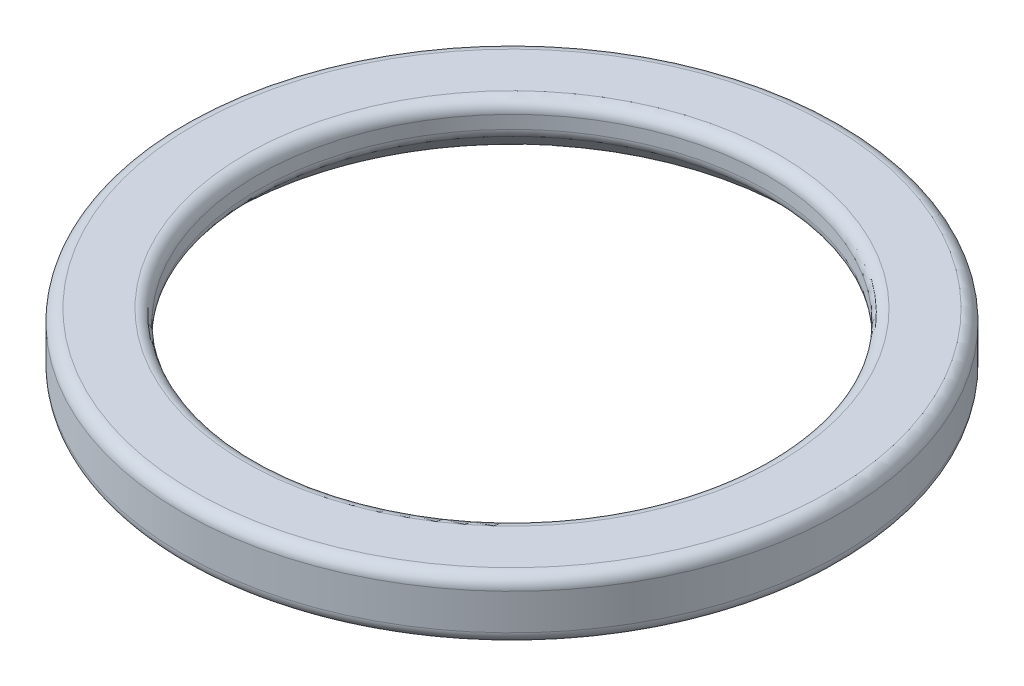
from build123d import *


with BuildPart() as part:
    # Esquisse1 → Base-R_volution (revolve)
    with BuildSketch(Plane.XY, mode=Mode.PRIVATE) as base_r_volution_sk:
        with BuildLine():
            Line((9.672559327, 0), (10.606873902, 0))
            ThreePointArc((10.606873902, 0), (10.889716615, 0.117157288), (11.006873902, 0.4))
            Line((11.006873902, 0.4), (11.006873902, 1.6))
            ThreePointArc((11.006873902, 1.6), (10.889716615, 1.882842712), (10.606873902, 2))
            Line((10.606873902, 2), (8.906873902, 2))
            ThreePointArc((8.906873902, 2), (8.62403119, 1.882842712), (8.506873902, 1.6))
            Line((8.506873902, 1.6), (8.506873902, 1.165685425))
            ThreePointArc((8.506873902, 1.165685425), (8.537322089, 1.012612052), (8.62403119, 0.882842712))
            Line((8.62403119, 0.882842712), (9.389716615, 0.117157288))
            ThreePointArc((9.389716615, 0.117157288), (9.519485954, 0.030448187), (9.672559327, 0))
        make_face()
    revolve(base_r_volution_sk.sketch.rotate(Axis((0.006873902, 0, 0), (0, 1, 0)), 90), axis=Axis((0.006873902, 0, 0), (0, 1, 0)))


solid = part.part
